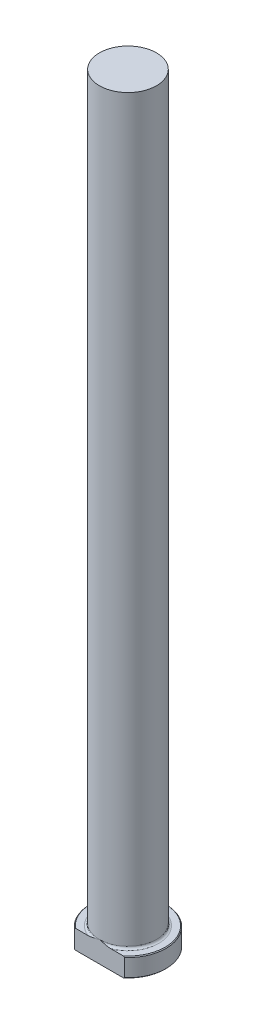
from build123d import *

# Parameters (mm, degrees)
CHAMFER1_SIZE = 0.254
FILLET1_R     = 0.762
KEY_DEPTH     = 255.634208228


with BuildPart() as part:
    # Sketch1 → Revolve1 (revolve)
    with BuildSketch(Plane.XY, mode=Mode.PRIVATE) as revolve1_sk:
        Polygon((0, 0), (-12.7, 0), (-12.7, 6.35), (-9.525, 6.35), (-9.525, 254), (0, 254), align=None)
    revolve(revolve1_sk.sketch.rotate(Axis((0, 259.958771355, 0), (0, -1, 0)), 270), axis=Axis((0, 259.958771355, 0), (0, -1, 0)))

    # Chamfer1
    chamfer1_edges = [part.edges().sort_by_distance(p)[0] for p in [
        (0, 6.35, -12.7),
        (0, 0, -12.7),
    ]]
    chamfer(chamfer1_edges, length=CHAMFER1_SIZE)

    # Fillet1
    fillet1_edges = [part.edges().sort_by_distance(p)[0] for p in [
        (0, 6.35, -9.525),
    ]]
    fillet(fillet1_edges, radius=FILLET1_R)

    # Sketch2 → KEY (cut, through all)
    with BuildSketch(Plane.XZ):
        with BuildLine():
            Line((-8.400260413, 9.525), (8.400260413, 9.525))
            ThreePointArc((8.400260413, 9.525), (0, 12.7), (-8.400260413, 9.525))
        make_face()
    extrude(amount=-KEY_DEPTH, mode=Mode.SUBTRACT)


solid = part.part
